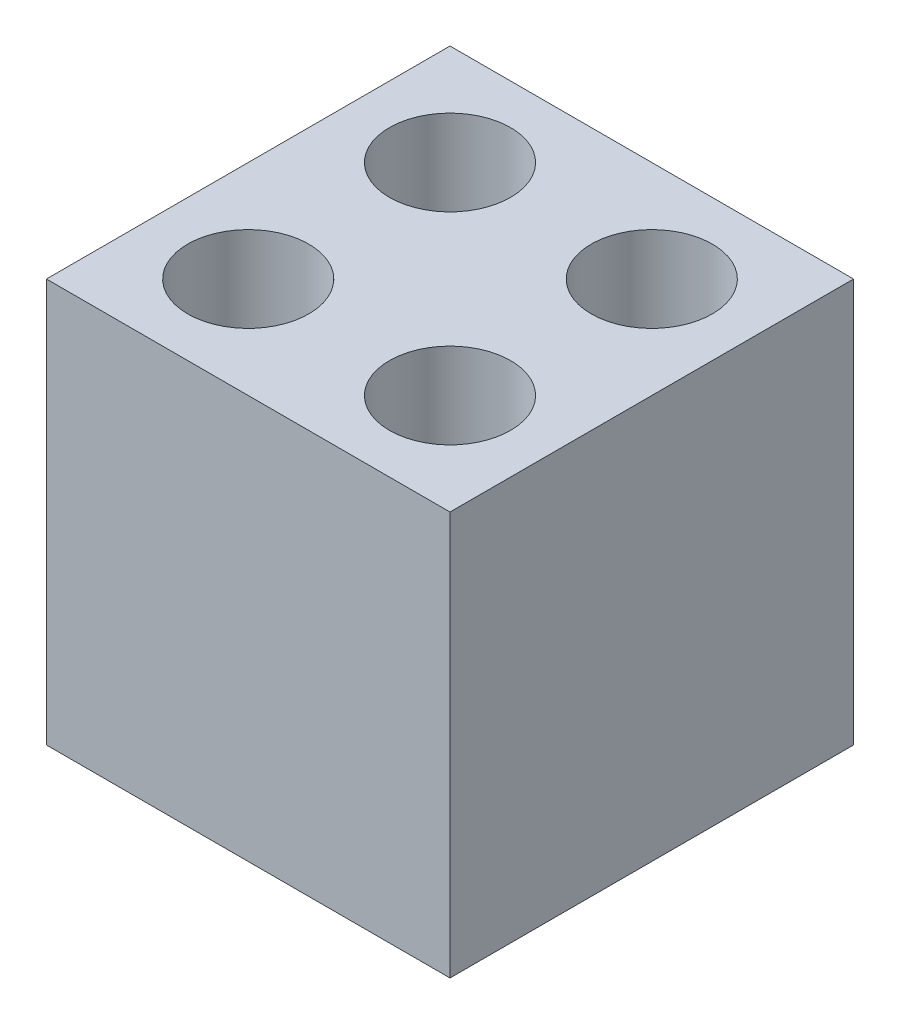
from build123d import *

# Parameters (mm, degrees)
SKETCH1_W             = 20
SKETCH1_H             = 20
BOSS_EXTRUDE1_DEPTH   = 10
M7X1_0_TAPPED_HOLE1_D = 6
M7X1_0_TAPPED_HOLE2_D = 6


with BuildPart() as part:
    # Sketch1 → Boss-Extrude1 (new, symmetric)
    with BuildSketch(Plane.XY):
        Rectangle(SKETCH1_W, SKETCH1_H)
    extrude(amount=BOSS_EXTRUDE1_DEPTH, both=True)

    # M7x1.0 Tapped Hole1 (through all)
    with Locations(Plane(origin=(0, 10, 0), x_dir=(1, 0, 0), z_dir=(0, 1, 0))):
        with Locations((-5, 5), (-5, -5)):
            Hole(M7X1_0_TAPPED_HOLE1_D / 2)

    # M7x1.0 Tapped Hole2 (through all)
    with Locations(Plane(origin=(0, 10, 0), x_dir=(1, 0, 0), z_dir=(0, 1, 0))):
        with Locations((5, 5), (5, -5)):
            Hole(M7X1_0_TAPPED_HOLE2_D / 2)


solid = part.part
